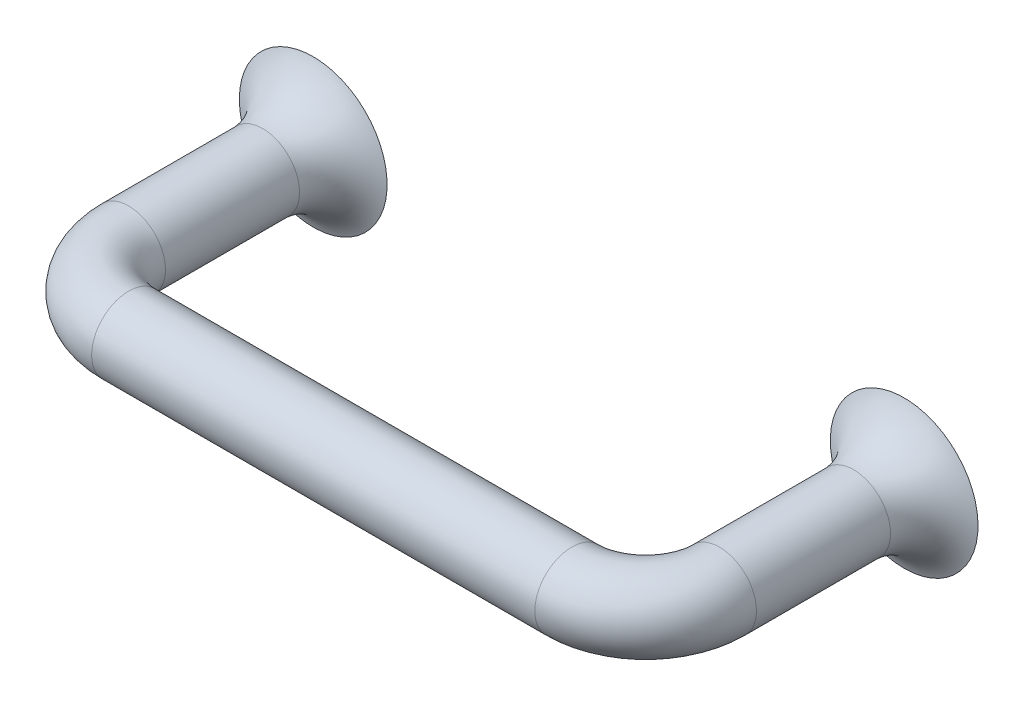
ISO-10303-21;
HEADER;
FILE_DESCRIPTION(('STEP AP214'),'2;1');
FILE_NAME('part.step','',(''),(''),'','','');
FILE_SCHEMA(('AUTOMOTIVE_DESIGN { 1 0 10303 214 1 1 1 1 }'));
ENDSEC;
DATA;
#1=APPLICATION_CONTEXT('core data for automotive mechanical design processes');
#2=APPLICATION_PROTOCOL_DEFINITION('international standard','automotive_design',2000,#1);
#3=PRODUCT_CONTEXT('',#1,'mechanical');
#4=PRODUCT('Part','Part','',(#3));
#5=PRODUCT_RELATED_PRODUCT_CATEGORY('part','',(#4));
#6=PRODUCT_DEFINITION_FORMATION('','',#4);
#7=PRODUCT_DEFINITION_CONTEXT('part definition',#1,'design');
#8=PRODUCT_DEFINITION('design','',#6,#7);
#9=PRODUCT_DEFINITION_SHAPE('','',#8);
#10=(LENGTH_UNIT() NAMED_UNIT(*) SI_UNIT(.MILLI.,.METRE.));
#11=(NAMED_UNIT(*) PLANE_ANGLE_UNIT() SI_UNIT($,.RADIAN.));
#12=(NAMED_UNIT(*) SI_UNIT($,.STERADIAN.) SOLID_ANGLE_UNIT());
#13=UNCERTAINTY_MEASURE_WITH_UNIT(LENGTH_MEASURE(1.E-05),#10,'distance_accuracy_value','');
#14=(GEOMETRIC_REPRESENTATION_CONTEXT(3) GLOBAL_UNCERTAINTY_ASSIGNED_CONTEXT((#13)) GLOBAL_UNIT_ASSIGNED_CONTEXT((#10,
#11,#12)) REPRESENTATION_CONTEXT('',''));
#15=CARTESIAN_POINT('',(0.,0.,0.));
#16=DIRECTION('',(0.,0.,1.));
#17=DIRECTION('',(1.,0.,0.));
#18=AXIS2_PLACEMENT_3D('',#15,#16,#17);
#19=CARTESIAN_POINT('',(0.,0.,37.5000000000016));
#20=DIRECTION('',(0.,0.,-1.));
#21=DIRECTION('',(0.,-1.,0.));
#22=AXIS2_PLACEMENT_3D('',#19,#20,#21);
#23=CYLINDRICAL_SURFACE('',#22,7.5);
#24=CARTESIAN_POINT('',(0.,0.,10.2736435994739));
#25=DIRECTION('',(0.,0.,1.));
#26=DIRECTION('',(1.,0.,0.));
#27=AXIS2_PLACEMENT_3D('',#24,#25,#26);
#28=CIRCLE('',#27,7.5);
#29=CARTESIAN_POINT('',(7.5,0.,10.2736435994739));
#30=VERTEX_POINT('',#29);
#31=EDGE_CURVE('E32',#30,#30,#28,.F.);
#32=ORIENTED_EDGE('',*,*,#31,.F.);
#33=EDGE_LOOP('',(#32));
#34=FACE_BOUND('',#33,.T.);
#35=CARTESIAN_POINT('',(0.,0.,37.5000000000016));
#36=DIRECTION('',(0.,0.,-1.));
#37=DIRECTION('',(0.,1.,0.));
#38=AXIS2_PLACEMENT_3D('',#35,#36,#37);
#39=CIRCLE('',#38,7.5);
#40=CARTESIAN_POINT('',(-7.5,0.,37.5000000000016));
#41=VERTEX_POINT('',#40);
#42=EDGE_CURVE('E35',#41,#41,#39,.T.);
#43=ORIENTED_EDGE('',*,*,#42,.T.);
#44=EDGE_LOOP('',(#43));
#45=FACE_BOUND('',#44,.T.);
#46=ADVANCED_FACE('F12',(#34,#45),#23,.T.);
#47=CARTESIAN_POINT('',(15.,0.,37.5000000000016));
#48=DIRECTION('',(0.,-1.,0.));
#49=DIRECTION('',(1.,0.,0.));
#50=AXIS2_PLACEMENT_3D('',#47,#48,#49);
#51=TOROIDAL_SURFACE('',#50,15.,7.5);
#52=CARTESIAN_POINT('',(15.,0.,52.5000000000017));
#53=DIRECTION('',(-1.,0.,0.));
#54=DIRECTION('',(0.,1.,0.));
#55=AXIS2_PLACEMENT_3D('',#52,#53,#54);
#56=CIRCLE('',#55,7.5);
#57=CARTESIAN_POINT('',(15.,0.,60.0000000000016));
#58=VERTEX_POINT('',#57);
#59=EDGE_CURVE('E43',#58,#58,#56,.T.);
#60=CARTESIAN_POINT('',(15.,0.,37.5000000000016));
#61=DIRECTION('',(0.,-1.,0.));
#62=DIRECTION('',(1.,0.,0.));
#63=AXIS2_PLACEMENT_3D('',#60,#61,#62);
#64=CIRCLE('',#63,22.5);
#65=EDGE_CURVE('',#58,#41,#64,.T.);
#66=ORIENTED_EDGE('',*,*,#59,.T.);
#67=ORIENTED_EDGE('',*,*,#42,.F.);
#68=ORIENTED_EDGE('',*,*,#65,.T.);
#69=ORIENTED_EDGE('',*,*,#65,.F.);
#70=EDGE_LOOP('',(#66,#68,#67,#69));
#71=FACE_BOUND('',#70,.T.);
#72=ADVANCED_FACE('F81',(#71),#51,.T.);
#73=CARTESIAN_POINT('',(105.,0.,52.5000000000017));
#74=DIRECTION('',(-1.,0.,0.));
#75=DIRECTION('',(0.,-1.,0.));
#76=AXIS2_PLACEMENT_3D('',#73,#74,#75);
#77=CYLINDRICAL_SURFACE('',#76,7.5);
#78=CARTESIAN_POINT('',(105.,0.,52.5000000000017));
#79=DIRECTION('',(-1.,0.,0.));
#80=DIRECTION('',(0.,1.,0.));
#81=AXIS2_PLACEMENT_3D('',#78,#79,#80);
#82=CIRCLE('',#81,7.5);
#83=CARTESIAN_POINT('',(105.,0.,60.0000000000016));
#84=VERTEX_POINT('',#83);
#85=EDGE_CURVE('E46',#84,#84,#82,.T.);
#86=ORIENTED_EDGE('',*,*,#85,.T.);
#87=EDGE_LOOP('',(#86));
#88=FACE_BOUND('',#87,.T.);
#89=ORIENTED_EDGE('',*,*,#59,.F.);
#90=EDGE_LOOP('',(#89));
#91=FACE_BOUND('',#90,.T.);
#92=ADVANCED_FACE('F88',(#88,#91),#77,.T.);
#93=CARTESIAN_POINT('',(105.,0.,37.5000000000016));
#94=DIRECTION('',(0.,-1.,0.));
#95=DIRECTION('',(1.,0.,0.));
#96=AXIS2_PLACEMENT_3D('',#93,#94,#95);
#97=TOROIDAL_SURFACE('',#96,15.,7.5);
#98=CARTESIAN_POINT('',(120.,0.,37.5000000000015));
#99=DIRECTION('',(0.,0.,1.));
#100=DIRECTION('',(0.,1.,0.));
#101=AXIS2_PLACEMENT_3D('',#98,#99,#100);
#102=CIRCLE('',#101,7.5);
#103=CARTESIAN_POINT('',(127.5,0.,37.5000000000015));
#104=VERTEX_POINT('',#103);
#105=EDGE_CURVE('E39',#104,#104,#102,.T.);
#106=CARTESIAN_POINT('',(105.,0.,37.5000000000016));
#107=DIRECTION('',(0.,-1.,0.));
#108=DIRECTION('',(1.,0.,0.));
#109=AXIS2_PLACEMENT_3D('',#106,#107,#108);
#110=CIRCLE('',#109,22.5);
#111=EDGE_CURVE('',#104,#84,#110,.T.);
#112=ORIENTED_EDGE('',*,*,#105,.T.);
#113=ORIENTED_EDGE('',*,*,#85,.F.);
#114=ORIENTED_EDGE('',*,*,#111,.T.);
#115=ORIENTED_EDGE('',*,*,#111,.F.);
#116=EDGE_LOOP('',(#112,#114,#113,#115));
#117=FACE_BOUND('',#116,.T.);
#118=ADVANCED_FACE('F131',(#117),#97,.T.);
#119=CARTESIAN_POINT('',(120.,0.,37.5000000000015));
#120=DIRECTION('',(0.,0.,-1.));
#121=DIRECTION('',(0.,-1.,0.));
#122=AXIS2_PLACEMENT_3D('',#119,#120,#121);
#123=CYLINDRICAL_SURFACE('',#122,7.5);
#124=CARTESIAN_POINT('',(120.,0.,10.2736435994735));
#125=DIRECTION('',(0.,0.,1.));
#126=DIRECTION('',(0.,1.,0.));
#127=AXIS2_PLACEMENT_3D('',#124,#125,#126);
#128=CIRCLE('',#127,7.5);
#129=CARTESIAN_POINT('',(120.,7.5,10.2736435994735));
#130=VERTEX_POINT('',#129);
#131=EDGE_CURVE('E36',#130,#130,#128,.T.);
#132=ORIENTED_EDGE('',*,*,#131,.T.);
#133=EDGE_LOOP('',(#132));
#134=FACE_BOUND('',#133,.T.);
#135=ORIENTED_EDGE('',*,*,#105,.F.);
#136=EDGE_LOOP('',(#135));
#137=FACE_BOUND('',#136,.T.);
#138=ADVANCED_FACE('F124',(#134,#137),#123,.T.);
#139=CARTESIAN_POINT('',(120.,0.,11.1368217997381));
#140=DIRECTION('',(0.,0.,-1.));
#141=DIRECTION('',(0.,-1.,0.));
#142=AXIS2_PLACEMENT_3D('',#139,#140,#141);
#143=TOROIDAL_SURFACE('',#142,19.4689148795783,12.);
#144=CARTESIAN_POINT('',(120.,0.,1.66906963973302E-12));
#145=DIRECTION('',(0.,0.,-1.));
#146=DIRECTION('',(0.,-1.,0.));
#147=AXIS2_PLACEMENT_3D('',#144,#145,#146);
#148=CIRCLE('',#147,15.);
#149=CARTESIAN_POINT('',(120.,-15.,1.66906963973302E-12));
#150=VERTEX_POINT('',#149);
#151=EDGE_CURVE('E40',#150,#150,#148,.T.);
#152=ORIENTED_EDGE('',*,*,#151,.F.);
#153=EDGE_LOOP('',(#152));
#154=FACE_BOUND('',#153,.T.);
#155=ORIENTED_EDGE('',*,*,#131,.F.);
#156=EDGE_LOOP('',(#155));
#157=FACE_BOUND('',#156,.T.);
#158=ADVANCED_FACE('F121',(#154,#157),#143,.F.);
#159=CARTESIAN_POINT('',(120.,0.,1.6713095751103E-12));
#160=DIRECTION('',(0.,0.,1.));
#161=DIRECTION('',(0.,1.,0.));
#162=AXIS2_PLACEMENT_3D('',#159,#160,#161);
#163=PLANE('',#162);
#164=CARTESIAN_POINT('',(120.,0.,1.6713095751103E-12));
#165=DIRECTION('',(0.,0.,1.));
#166=DIRECTION('',(1.,0.,0.));
#167=AXIS2_PLACEMENT_3D('',#164,#165,#166);
#168=CIRCLE('',#167,3.45000000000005);
#169=CARTESIAN_POINT('',(123.45,0.,1.6713095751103E-12));
#170=VERTEX_POINT('',#169);
#171=EDGE_CURVE('E23',#170,#170,#168,.T.);
#172=ORIENTED_EDGE('',*,*,#171,.T.);
#173=EDGE_LOOP('',(#172));
#174=FACE_BOUND('',#173,.T.);
#175=ORIENTED_EDGE('',*,*,#151,.T.);
#176=EDGE_LOOP('',(#175));
#177=FACE_BOUND('',#176,.T.);
#178=ADVANCED_FACE('F119',(#174,#177),#163,.F.);
#179=CARTESIAN_POINT('',(0.,0.,11.1368217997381));
#180=DIRECTION('',(0.,0.,-1.));
#181=DIRECTION('',(-1.,0.,0.));
#182=AXIS2_PLACEMENT_3D('',#179,#180,#181);
#183=TOROIDAL_SURFACE('',#182,19.4689148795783,12.);
#184=ORIENTED_EDGE('',*,*,#31,.T.);
#185=EDGE_LOOP('',(#184));
#186=FACE_BOUND('',#185,.T.);
#187=CARTESIAN_POINT('',(0.,0.,1.65830714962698E-12));
#188=DIRECTION('',(0.,0.,-1.));
#189=DIRECTION('',(-1.,0.,0.));
#190=AXIS2_PLACEMENT_3D('',#187,#188,#189);
#191=CIRCLE('',#190,15.);
#192=CARTESIAN_POINT('',(-15.,0.,1.66871549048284E-12));
#193=VERTEX_POINT('',#192);
#194=EDGE_CURVE('E53',#193,#193,#191,.T.);
#195=ORIENTED_EDGE('',*,*,#194,.F.);
#196=EDGE_LOOP('',(#195));
#197=FACE_BOUND('',#196,.T.);
#198=ADVANCED_FACE('F114',(#186,#197),#183,.F.);
#199=CARTESIAN_POINT('',(0.,0.,1.67824846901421E-12));
#200=DIRECTION('',(0.,0.,-1.));
#201=DIRECTION('',(0.,1.,0.));
#202=AXIS2_PLACEMENT_3D('',#199,#200,#201);
#203=PLANE('',#202);
#204=CARTESIAN_POINT('',(0.,0.,1.67824846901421E-12));
#205=DIRECTION('',(0.,0.,-1.));
#206=DIRECTION('',(-1.,0.,0.));
#207=AXIS2_PLACEMENT_3D('',#204,#205,#206);
#208=CIRCLE('',#207,3.44999999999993);
#209=CARTESIAN_POINT('',(-3.44999999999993,0.,1.58214816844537E-12));
#210=VERTEX_POINT('',#209);
#211=EDGE_CURVE('E8',#210,#210,#208,.F.);
#212=ORIENTED_EDGE('',*,*,#211,.T.);
#213=EDGE_LOOP('',(#212));
#214=FACE_BOUND('',#213,.T.);
#215=ORIENTED_EDGE('',*,*,#194,.T.);
#216=EDGE_LOOP('',(#215));
#217=FACE_BOUND('',#216,.T.);
#218=ADVANCED_FACE('F107',(#214,#217),#203,.T.);
#219=CARTESIAN_POINT('',(120.,0.,12.0000000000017));
#220=DIRECTION('',(0.,0.,-1.));
#221=DIRECTION('',(0.,-1.,0.));
#222=AXIS2_PLACEMENT_3D('',#219,#220,#221);
#223=CYLINDRICAL_SURFACE('',#222,3.);
#224=CARTESIAN_POINT('',(120.,0.,0.450000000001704));
#225=DIRECTION('',(0.,0.,1.));
#226=DIRECTION('',(1.,0.,0.));
#227=AXIS2_PLACEMENT_3D('',#224,#225,#226);
#228=CIRCLE('',#227,3.);
#229=CARTESIAN_POINT('',(123.,0.,0.450000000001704));
#230=VERTEX_POINT('',#229);
#231=EDGE_CURVE('E27',#230,#230,#228,.F.);
#232=ORIENTED_EDGE('',*,*,#231,.T.);
#233=EDGE_LOOP('',(#232));
#234=FACE_BOUND('',#233,.T.);
#235=CARTESIAN_POINT('',(120.,0.,12.0000000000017));
#236=DIRECTION('',(0.,0.,-1.));
#237=DIRECTION('',(0.,-1.,0.));
#238=AXIS2_PLACEMENT_3D('',#235,#236,#237);
#239=CIRCLE('',#238,3.);
#240=CARTESIAN_POINT('',(120.,-3.,12.0000000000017));
#241=VERTEX_POINT('',#240);
#242=EDGE_CURVE('E56',#241,#241,#239,.T.);
#243=ORIENTED_EDGE('',*,*,#242,.F.);
#244=EDGE_LOOP('',(#243));
#245=FACE_BOUND('',#244,.T.);
#246=ADVANCED_FACE('F77',(#234,#245),#223,.F.);
#247=CARTESIAN_POINT('',(120.,0.,12.0000000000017));
#248=DIRECTION('',(0.,0.,-1.));
#249=DIRECTION('',(0.,-1.,0.));
#250=AXIS2_PLACEMENT_3D('',#247,#248,#249);
#251=PLANE('',#250);
#252=ORIENTED_EDGE('',*,*,#242,.T.);
#253=EDGE_LOOP('',(#252));
#254=FACE_BOUND('',#253,.T.);
#255=ADVANCED_FACE('F67',(#254),#251,.T.);
#256=CARTESIAN_POINT('',(0.,0.,12.0000000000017));
#257=DIRECTION('',(0.,0.,-1.));
#258=DIRECTION('',(0.,-1.,0.));
#259=AXIS2_PLACEMENT_3D('',#256,#257,#258);
#260=CYLINDRICAL_SURFACE('',#259,3.);
#261=CARTESIAN_POINT('',(0.,0.,0.4500000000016));
#262=DIRECTION('',(0.,0.,-1.));
#263=DIRECTION('',(-1.,0.,0.));
#264=AXIS2_PLACEMENT_3D('',#261,#262,#263);
#265=CIRCLE('',#264,3.);
#266=CARTESIAN_POINT('',(-3.,0.,0.4500000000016));
#267=VERTEX_POINT('',#266);
#268=EDGE_CURVE('E19',#267,#267,#265,.T.);
#269=ORIENTED_EDGE('',*,*,#268,.T.);
#270=EDGE_LOOP('',(#269));
#271=FACE_BOUND('',#270,.T.);
#272=CARTESIAN_POINT('',(0.,0.,12.0000000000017));
#273=DIRECTION('',(0.,0.,-1.));
#274=DIRECTION('',(0.,-1.,0.));
#275=AXIS2_PLACEMENT_3D('',#272,#273,#274);
#276=CIRCLE('',#275,3.);
#277=CARTESIAN_POINT('',(0.,-3.,12.0000000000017));
#278=VERTEX_POINT('',#277);
#279=EDGE_CURVE('E59',#278,#278,#276,.T.);
#280=ORIENTED_EDGE('',*,*,#279,.F.);
#281=EDGE_LOOP('',(#280));
#282=FACE_BOUND('',#281,.T.);
#283=ADVANCED_FACE('F65',(#271,#282),#260,.F.);
#284=CARTESIAN_POINT('',(0.,0.,12.0000000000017));
#285=DIRECTION('',(0.,0.,-1.));
#286=DIRECTION('',(0.,-1.,0.));
#287=AXIS2_PLACEMENT_3D('',#284,#285,#286);
#288=PLANE('',#287);
#289=ORIENTED_EDGE('',*,*,#279,.T.);
#290=EDGE_LOOP('',(#289));
#291=FACE_BOUND('',#290,.T.);
#292=ADVANCED_FACE('F63',(#291),#288,.T.);
#293=CARTESIAN_POINT('',(120.,0.,0.450000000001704));
#294=DIRECTION('',(0.,0.,-1.));
#295=DIRECTION('',(-1.,0.,0.));
#296=AXIS2_PLACEMENT_3D('',#293,#294,#295);
#297=CONICAL_SURFACE('',#296,3.,0.785398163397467);
#298=ORIENTED_EDGE('',*,*,#171,.F.);
#299=EDGE_LOOP('',(#298));
#300=FACE_BOUND('',#299,.T.);
#301=ORIENTED_EDGE('',*,*,#231,.F.);
#302=EDGE_LOOP('',(#301));
#303=FACE_BOUND('',#302,.T.);
#304=ADVANCED_FACE('F75',(#300,#303),#297,.F.);
#305=CARTESIAN_POINT('',(0.,0.,0.4500000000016));
#306=DIRECTION('',(0.,0.,-1.));
#307=DIRECTION('',(-1.,0.,0.));
#308=AXIS2_PLACEMENT_3D('',#305,#306,#307);
#309=CONICAL_SURFACE('',#308,3.,0.785398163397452);
#310=ORIENTED_EDGE('',*,*,#211,.F.);
#311=EDGE_LOOP('',(#310));
#312=FACE_BOUND('',#311,.T.);
#313=ORIENTED_EDGE('',*,*,#268,.F.);
#314=EDGE_LOOP('',(#313));
#315=FACE_BOUND('',#314,.T.);
#316=ADVANCED_FACE('F14',(#312,#315),#309,.F.);
#317=CLOSED_SHELL('',(#46,#72,#92,#118,#138,#158,#178,#198,#218,#246,#255,#283,#292,#304,#316));
#318=MANIFOLD_SOLID_BREP('B1',#317);
#319=ADVANCED_BREP_SHAPE_REPRESENTATION('',(#18,#318),#14);
#320=SHAPE_DEFINITION_REPRESENTATION(#9,#319);
ENDSEC;
END-ISO-10303-21;
